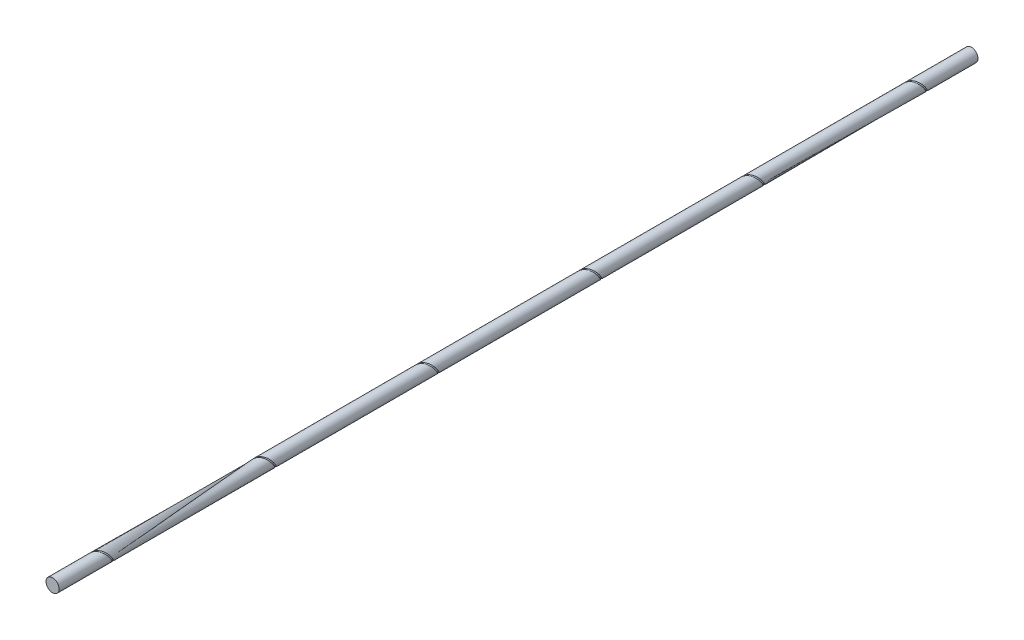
from build123d import *

# Parameters (mm, degrees)
SKETCH1_R              = 25
BOSS_EXTRUDE1_DEPTH    = 3500
CUT_SWEEP1_PITCH       = 100
CUT_SWEEP1_HEIGHT      = 100
CUT_SWEEP1_RADIUS      = 27.646
CUT_SWEEP1_START_ANGLE = -180
SKETCH3_R              = 3.969
LPATTERN1_COUNT        = 6
LPATTERN1_PITCH        = 620


with BuildPart() as part:
    # Sketch1 → Boss-Extrude1 (new body)
    with BuildSketch(Plane.XY):
        Circle(SKETCH1_R)
    extrude(amount=BOSS_EXTRUDE1_DEPTH)

    # Cut-Sweep1: sweep along a helix
    with BuildLine() as cut_sweep1_path:
        add(Helix(CUT_SWEEP1_PITCH, CUT_SWEEP1_HEIGHT, CUT_SWEEP1_RADIUS, center=(0, 0, 150), direction=(0, 0, 1), mode=Mode.PRIVATE).rotate(Axis((0, 0, 150), (0, 0, 1)), CUT_SWEEP1_START_ANGLE))
    # Sketch3 → Cut-Sweep1 (sweep, cut)
    with BuildSketch(Plane(origin=(0, 0, 0), x_dir=(1, 0, 0), z_dir=(0, 1, 0))):
        with Locations((-27.646, -150)):
            Circle(SKETCH3_R)
    cut_sweep1 = sweep(path=cut_sweep1_path.line, is_frenet=True, mode=Mode.SUBTRACT)

    # LPattern1: Cut-Sweep1 ×6
    with Locations(*[(0, 0, i * LPATTERN1_PITCH) for i in range(1, LPATTERN1_COUNT)]):
        add(cut_sweep1, mode=Mode.SUBTRACT)


solid = part.part
